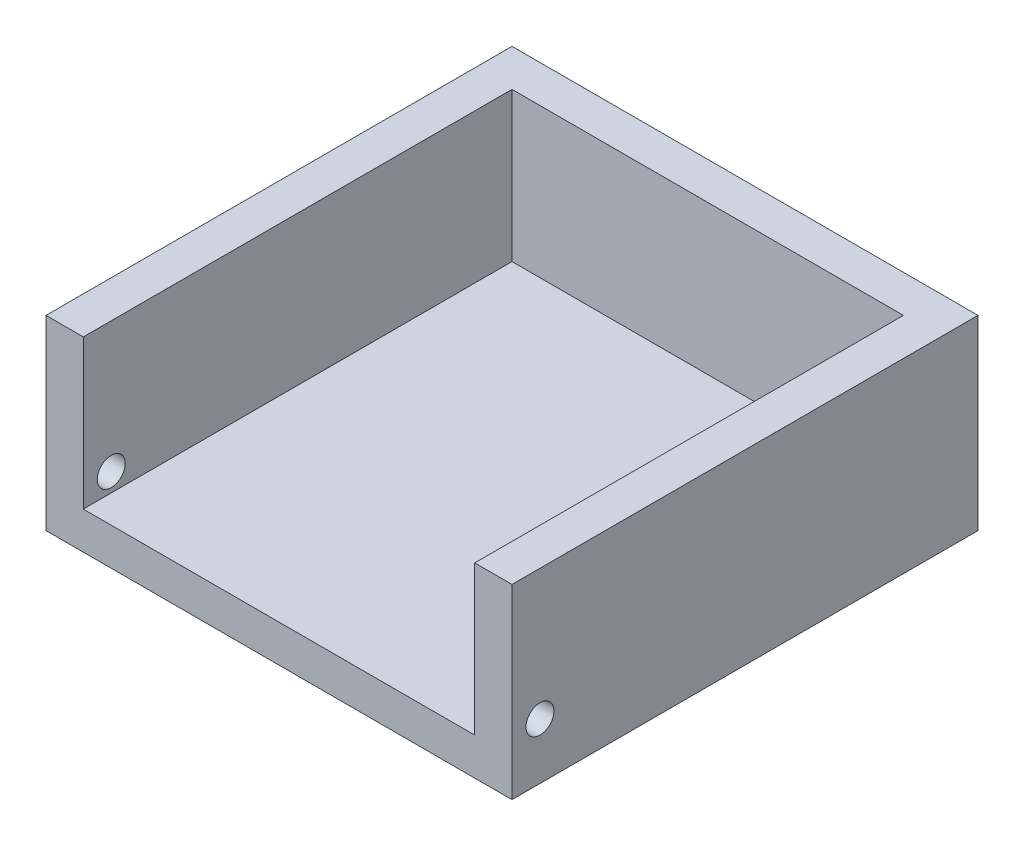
from build123d import *

# Parameters (mm, degrees)
ESQUISSE1_W             = 50
ESQUISSE1_H             = 50
BOSS_EXTRU_1_DEPTH      = 4
BOSS_EXTRU_2_DEPTH      = 16
ESQUISSE3_R             = 1.5
ENL_V_MAT_EXTRU_1_DEPTH = 60.371710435


with BuildPart() as part:
    # Esquisse1 → Boss.-Extru.1 (new body)
    with BuildSketch(Plane(origin=(0, 0, 0), x_dir=(1, 0, 0), z_dir=(0, 1, 0))):
        Rectangle(ESQUISSE1_W, ESQUISSE1_H)
    extrude(amount=BOSS_EXTRU_1_DEPTH)

    # Esquisse2 → Boss.-Extru.2 (add)
    with BuildSketch(Plane(origin=(0, 4, 0), x_dir=(1, 0, 0), z_dir=(0, 1, 0))):
        Polygon((-25, -25), (-25, 25), (25, 25), (25, -25), (21, -25), (21, 21), (-21, 21), (-21, -25), align=None)
    extrude(amount=BOSS_EXTRU_2_DEPTH)

    # Esquisse3 → Enl_v. mat.-Extru.1 (cut, through all)
    with BuildSketch(Plane.ZY.offset(25)):
        with Locations((22, 6)):
            Circle(ESQUISSE3_R)
    extrude(amount=-ENL_V_MAT_EXTRU_1_DEPTH, mode=Mode.SUBTRACT)


solid = part.part
